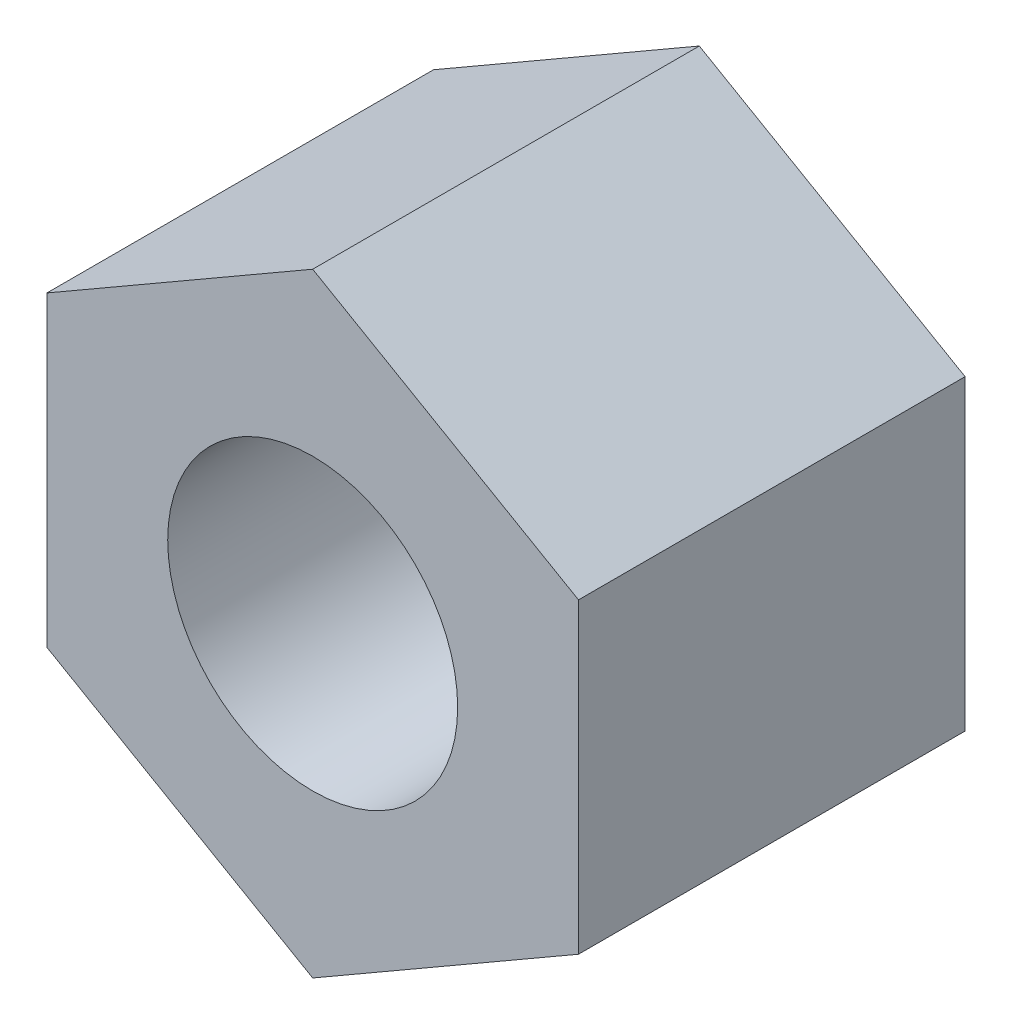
ISO-10303-21;
HEADER;
FILE_DESCRIPTION(('STEP AP214'),'2;1');
FILE_NAME('part.step','',(''),(''),'','','');
FILE_SCHEMA(('AUTOMOTIVE_DESIGN { 1 0 10303 214 1 1 1 1 }'));
ENDSEC;
DATA;
#1=APPLICATION_CONTEXT('core data for automotive mechanical design processes');
#2=APPLICATION_PROTOCOL_DEFINITION('international standard','automotive_design',2000,#1);
#3=PRODUCT_CONTEXT('',#1,'mechanical');
#4=PRODUCT('Part','Part','',(#3));
#5=PRODUCT_RELATED_PRODUCT_CATEGORY('part','',(#4));
#6=PRODUCT_DEFINITION_FORMATION('','',#4);
#7=PRODUCT_DEFINITION_CONTEXT('part definition',#1,'design');
#8=PRODUCT_DEFINITION('design','',#6,#7);
#9=PRODUCT_DEFINITION_SHAPE('','',#8);
#10=(LENGTH_UNIT() NAMED_UNIT(*) SI_UNIT(.MILLI.,.METRE.));
#11=(NAMED_UNIT(*) PLANE_ANGLE_UNIT() SI_UNIT($,.RADIAN.));
#12=(NAMED_UNIT(*) SI_UNIT($,.STERADIAN.) SOLID_ANGLE_UNIT());
#13=UNCERTAINTY_MEASURE_WITH_UNIT(LENGTH_MEASURE(1.E-05),#10,'distance_accuracy_value','');
#14=(GEOMETRIC_REPRESENTATION_CONTEXT(3) GLOBAL_UNCERTAINTY_ASSIGNED_CONTEXT((#13)) GLOBAL_UNIT_ASSIGNED_CONTEXT((#10,
#11,#12)) REPRESENTATION_CONTEXT('',''));
#15=CARTESIAN_POINT('',(0.,0.,0.));
#16=DIRECTION('',(0.,0.,1.));
#17=DIRECTION('',(1.,0.,0.));
#18=AXIS2_PLACEMENT_3D('',#15,#16,#17);
#19=CARTESIAN_POINT('',(0.,0.,4.));
#20=DIRECTION('',(0.,0.,1.));
#21=DIRECTION('',(1.,0.,0.));
#22=AXIS2_PLACEMENT_3D('',#19,#20,#21);
#23=PLANE('',#22);
#24=DIRECTION('',(0.,1.,0.));
#25=VECTOR('',#24,1.);
#26=CARTESIAN_POINT('',(2.75,-1.58771324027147,4.));
#27=LINE('',#26,#25);
#28=CARTESIAN_POINT('',(2.75,-1.58771324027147,4.));
#29=VERTEX_POINT('',#28);
#30=CARTESIAN_POINT('',(2.75,1.58771324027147,4.));
#31=VERTEX_POINT('',#30);
#32=EDGE_CURVE('E139',#29,#31,#27,.T.);
#33=ORIENTED_EDGE('',*,*,#32,.T.);
#34=DIRECTION('',(-0.866025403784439,0.5,0.));
#35=VECTOR('',#34,1.);
#36=CARTESIAN_POINT('',(2.75,1.58771324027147,4.));
#37=LINE('',#36,#35);
#38=CARTESIAN_POINT('',(0.,3.17542648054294,4.));
#39=VERTEX_POINT('',#38);
#40=EDGE_CURVE('E97',#31,#39,#37,.T.);
#41=ORIENTED_EDGE('',*,*,#40,.T.);
#42=DIRECTION('',(-0.866025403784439,-0.5,0.));
#43=VECTOR('',#42,1.);
#44=CARTESIAN_POINT('',(0.,3.17542648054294,4.));
#45=LINE('',#44,#43);
#46=CARTESIAN_POINT('',(-2.75,1.58771324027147,4.));
#47=VERTEX_POINT('',#46);
#48=EDGE_CURVE('E110',#39,#47,#45,.T.);
#49=ORIENTED_EDGE('',*,*,#48,.T.);
#50=DIRECTION('',(0.,-1.,0.));
#51=VECTOR('',#50,1.);
#52=CARTESIAN_POINT('',(-2.75,1.58771324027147,4.));
#53=LINE('',#52,#51);
#54=CARTESIAN_POINT('',(-2.75,-1.58771324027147,4.));
#55=VERTEX_POINT('',#54);
#56=EDGE_CURVE('E104',#47,#55,#53,.T.);
#57=ORIENTED_EDGE('',*,*,#56,.T.);
#58=DIRECTION('',(0.866025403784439,-0.5,0.));
#59=VECTOR('',#58,1.);
#60=CARTESIAN_POINT('',(-2.75,-1.58771324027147,4.));
#61=LINE('',#60,#59);
#62=CARTESIAN_POINT('',(0.,-3.17542648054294,4.));
#63=VERTEX_POINT('',#62);
#64=EDGE_CURVE('E108',#55,#63,#61,.T.);
#65=ORIENTED_EDGE('',*,*,#64,.T.);
#66=DIRECTION('',(0.866025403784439,0.5,0.));
#67=VECTOR('',#66,1.);
#68=CARTESIAN_POINT('',(0.,-3.17542648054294,4.));
#69=LINE('',#68,#67);
#70=EDGE_CURVE('E60',#63,#29,#69,.T.);
#71=ORIENTED_EDGE('',*,*,#70,.T.);
#72=EDGE_LOOP('',(#33,#41,#49,#57,#65,#71));
#73=FACE_BOUND('',#72,.T.);
#74=CARTESIAN_POINT('',(0.,0.,4.));
#75=DIRECTION('',(0.,0.,1.));
#76=DIRECTION('',(1.,0.,0.));
#77=AXIS2_PLACEMENT_3D('',#74,#75,#76);
#78=CIRCLE('',#77,1.5);
#79=CARTESIAN_POINT('',(1.5,0.,4.));
#80=VERTEX_POINT('',#79);
#81=EDGE_CURVE('E132',#80,#80,#78,.T.);
#82=ORIENTED_EDGE('',*,*,#81,.F.);
#83=EDGE_LOOP('',(#82));
#84=FACE_BOUND('',#83,.T.);
#85=ADVANCED_FACE('F43',(#73,#84),#23,.T.);
#86=CARTESIAN_POINT('',(0.,0.,0.));
#87=DIRECTION('',(0.,0.,1.));
#88=DIRECTION('',(1.,0.,0.));
#89=AXIS2_PLACEMENT_3D('',#86,#87,#88);
#90=PLANE('',#89);
#91=DIRECTION('',(0.,1.,0.));
#92=VECTOR('',#91,1.);
#93=CARTESIAN_POINT('',(2.75,-1.58771324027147,0.));
#94=LINE('',#93,#92);
#95=CARTESIAN_POINT('',(2.75,-1.58771324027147,0.));
#96=VERTEX_POINT('',#95);
#97=CARTESIAN_POINT('',(2.75,1.58771324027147,0.));
#98=VERTEX_POINT('',#97);
#99=EDGE_CURVE('E128',#96,#98,#94,.T.);
#100=ORIENTED_EDGE('',*,*,#99,.F.);
#101=DIRECTION('',(0.866025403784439,0.5,0.));
#102=VECTOR('',#101,1.);
#103=CARTESIAN_POINT('',(0.,-3.17542648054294,0.));
#104=LINE('',#103,#102);
#105=CARTESIAN_POINT('',(0.,-3.17542648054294,0.));
#106=VERTEX_POINT('',#105);
#107=EDGE_CURVE('E89',#106,#96,#104,.T.);
#108=ORIENTED_EDGE('',*,*,#107,.F.);
#109=DIRECTION('',(0.866025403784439,-0.5,0.));
#110=VECTOR('',#109,1.);
#111=CARTESIAN_POINT('',(-2.75,-1.58771324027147,0.));
#112=LINE('',#111,#110);
#113=CARTESIAN_POINT('',(-2.75,-1.58771324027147,0.));
#114=VERTEX_POINT('',#113);
#115=EDGE_CURVE('E83',#114,#106,#112,.T.);
#116=ORIENTED_EDGE('',*,*,#115,.F.);
#117=DIRECTION('',(0.,-1.,0.));
#118=VECTOR('',#117,1.);
#119=CARTESIAN_POINT('',(-2.75,1.58771324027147,0.));
#120=LINE('',#119,#118);
#121=CARTESIAN_POINT('',(-2.75,1.58771324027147,0.));
#122=VERTEX_POINT('',#121);
#123=EDGE_CURVE('E118',#122,#114,#120,.T.);
#124=ORIENTED_EDGE('',*,*,#123,.F.);
#125=DIRECTION('',(-0.866025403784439,-0.5,0.));
#126=VECTOR('',#125,1.);
#127=CARTESIAN_POINT('',(0.,3.17542648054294,0.));
#128=LINE('',#127,#126);
#129=CARTESIAN_POINT('',(0.,3.17542648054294,0.));
#130=VERTEX_POINT('',#129);
#131=EDGE_CURVE('E134',#130,#122,#128,.T.);
#132=ORIENTED_EDGE('',*,*,#131,.F.);
#133=DIRECTION('',(-0.866025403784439,0.5,0.));
#134=VECTOR('',#133,1.);
#135=CARTESIAN_POINT('',(2.75,1.58771324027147,0.));
#136=LINE('',#135,#134);
#137=EDGE_CURVE('E131',#98,#130,#136,.T.);
#138=ORIENTED_EDGE('',*,*,#137,.F.);
#139=EDGE_LOOP('',(#100,#108,#116,#124,#132,#138));
#140=FACE_BOUND('',#139,.T.);
#141=CARTESIAN_POINT('',(0.,0.,0.));
#142=DIRECTION('',(0.,0.,1.));
#143=DIRECTION('',(1.,0.,0.));
#144=AXIS2_PLACEMENT_3D('',#141,#142,#143);
#145=CIRCLE('',#144,1.5);
#146=CARTESIAN_POINT('',(1.5,0.,0.));
#147=VERTEX_POINT('',#146);
#148=EDGE_CURVE('E232',#147,#147,#145,.T.);
#149=ORIENTED_EDGE('',*,*,#148,.T.);
#150=EDGE_LOOP('',(#149));
#151=FACE_BOUND('',#150,.T.);
#152=ADVANCED_FACE('F148',(#140,#151),#90,.F.);
#153=CARTESIAN_POINT('',(2.75,-1.58771324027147,4.));
#154=DIRECTION('',(-1.,0.,0.));
#155=DIRECTION('',(0.,-1.,0.));
#156=AXIS2_PLACEMENT_3D('',#153,#154,#155);
#157=PLANE('',#156);
#158=ORIENTED_EDGE('',*,*,#99,.T.);
#159=DIRECTION('',(0.,0.,-1.));
#160=VECTOR('',#159,1.);
#161=CARTESIAN_POINT('',(2.75,1.58771324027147,4.));
#162=LINE('',#161,#160);
#163=EDGE_CURVE('E11',#31,#98,#162,.T.);
#164=ORIENTED_EDGE('',*,*,#163,.F.);
#165=ORIENTED_EDGE('',*,*,#32,.F.);
#166=DIRECTION('',(0.,0.,-1.));
#167=VECTOR('',#166,1.);
#168=CARTESIAN_POINT('',(2.75,-1.58771324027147,4.));
#169=LINE('',#168,#167);
#170=EDGE_CURVE('E124',#29,#96,#169,.T.);
#171=ORIENTED_EDGE('',*,*,#170,.T.);
#172=EDGE_LOOP('',(#158,#164,#165,#171));
#173=FACE_BOUND('',#172,.T.);
#174=ADVANCED_FACE('F45',(#173),#157,.F.);
#175=CARTESIAN_POINT('',(2.75,1.58771324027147,4.));
#176=DIRECTION('',(-0.5,-0.866025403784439,0.));
#177=DIRECTION('',(0.866025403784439,-0.5,0.));
#178=AXIS2_PLACEMENT_3D('',#175,#176,#177);
#179=PLANE('',#178);
#180=ORIENTED_EDGE('',*,*,#137,.T.);
#181=DIRECTION('',(0.,0.,-1.));
#182=VECTOR('',#181,1.);
#183=CARTESIAN_POINT('',(0.,3.17542648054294,4.));
#184=LINE('',#183,#182);
#185=EDGE_CURVE('E52',#39,#130,#184,.T.);
#186=ORIENTED_EDGE('',*,*,#185,.F.);
#187=ORIENTED_EDGE('',*,*,#40,.F.);
#188=ORIENTED_EDGE('',*,*,#163,.T.);
#189=EDGE_LOOP('',(#180,#186,#187,#188));
#190=FACE_BOUND('',#189,.T.);
#191=ADVANCED_FACE('F173',(#190),#179,.F.);
#192=CARTESIAN_POINT('',(0.,3.17542648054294,4.));
#193=DIRECTION('',(0.5,-0.866025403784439,0.));
#194=DIRECTION('',(0.866025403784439,0.5,0.));
#195=AXIS2_PLACEMENT_3D('',#192,#193,#194);
#196=PLANE('',#195);
#197=ORIENTED_EDGE('',*,*,#131,.T.);
#198=DIRECTION('',(0.,0.,-1.));
#199=VECTOR('',#198,1.);
#200=CARTESIAN_POINT('',(-2.75,1.58771324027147,4.));
#201=LINE('',#200,#199);
#202=EDGE_CURVE('E119',#47,#122,#201,.T.);
#203=ORIENTED_EDGE('',*,*,#202,.F.);
#204=ORIENTED_EDGE('',*,*,#48,.F.);
#205=ORIENTED_EDGE('',*,*,#185,.T.);
#206=EDGE_LOOP('',(#197,#203,#204,#205));
#207=FACE_BOUND('',#206,.T.);
#208=ADVANCED_FACE('F145',(#207),#196,.F.);
#209=CARTESIAN_POINT('',(-2.75,1.58771324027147,4.));
#210=DIRECTION('',(1.,0.,0.));
#211=DIRECTION('',(0.,1.,0.));
#212=AXIS2_PLACEMENT_3D('',#209,#210,#211);
#213=PLANE('',#212);
#214=ORIENTED_EDGE('',*,*,#123,.T.);
#215=DIRECTION('',(0.,0.,-1.));
#216=VECTOR('',#215,1.);
#217=CARTESIAN_POINT('',(-2.75,-1.58771324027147,4.));
#218=LINE('',#217,#216);
#219=EDGE_CURVE('E115',#55,#114,#218,.T.);
#220=ORIENTED_EDGE('',*,*,#219,.F.);
#221=ORIENTED_EDGE('',*,*,#56,.F.);
#222=ORIENTED_EDGE('',*,*,#202,.T.);
#223=EDGE_LOOP('',(#214,#220,#221,#222));
#224=FACE_BOUND('',#223,.T.);
#225=ADVANCED_FACE('F116',(#224),#213,.F.);
#226=CARTESIAN_POINT('',(-2.75,-1.58771324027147,4.));
#227=DIRECTION('',(0.5,0.866025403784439,0.));
#228=DIRECTION('',(-0.866025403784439,0.5,0.));
#229=AXIS2_PLACEMENT_3D('',#226,#227,#228);
#230=PLANE('',#229);
#231=ORIENTED_EDGE('',*,*,#115,.T.);
#232=DIRECTION('',(0.,0.,-1.));
#233=VECTOR('',#232,1.);
#234=CARTESIAN_POINT('',(0.,-3.17542648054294,4.));
#235=LINE('',#234,#233);
#236=EDGE_CURVE('E120',#63,#106,#235,.T.);
#237=ORIENTED_EDGE('',*,*,#236,.F.);
#238=ORIENTED_EDGE('',*,*,#64,.F.);
#239=ORIENTED_EDGE('',*,*,#219,.T.);
#240=EDGE_LOOP('',(#231,#237,#238,#239));
#241=FACE_BOUND('',#240,.T.);
#242=ADVANCED_FACE('F122',(#241),#230,.F.);
#243=CARTESIAN_POINT('',(0.,-3.17542648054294,4.));
#244=DIRECTION('',(-0.5,0.866025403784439,0.));
#245=DIRECTION('',(-0.866025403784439,-0.5,0.));
#246=AXIS2_PLACEMENT_3D('',#243,#244,#245);
#247=PLANE('',#246);
#248=ORIENTED_EDGE('',*,*,#107,.T.);
#249=ORIENTED_EDGE('',*,*,#170,.F.);
#250=ORIENTED_EDGE('',*,*,#70,.F.);
#251=ORIENTED_EDGE('',*,*,#236,.T.);
#252=EDGE_LOOP('',(#248,#249,#250,#251));
#253=FACE_BOUND('',#252,.T.);
#254=ADVANCED_FACE('F153',(#253),#247,.F.);
#255=CARTESIAN_POINT('',(0.,0.,4.));
#256=DIRECTION('',(0.,0.,-1.));
#257=DIRECTION('',(-1.,0.,0.));
#258=AXIS2_PLACEMENT_3D('',#255,#256,#257);
#259=CYLINDRICAL_SURFACE('',#258,1.5);
#260=ORIENTED_EDGE('',*,*,#81,.T.);
#261=EDGE_LOOP('',(#260));
#262=FACE_BOUND('',#261,.T.);
#263=ORIENTED_EDGE('',*,*,#148,.F.);
#264=EDGE_LOOP('',(#263));
#265=FACE_BOUND('',#264,.T.);
#266=ADVANCED_FACE('F155',(#262,#265),#259,.F.);
#267=CLOSED_SHELL('',(#85,#152,#174,#191,#208,#225,#242,#254,#266));
#268=MANIFOLD_SOLID_BREP('B2',#267);
#269=ADVANCED_BREP_SHAPE_REPRESENTATION('',(#18,#268),#14);
#270=SHAPE_DEFINITION_REPRESENTATION(#9,#269);
ENDSEC;
END-ISO-10303-21;
